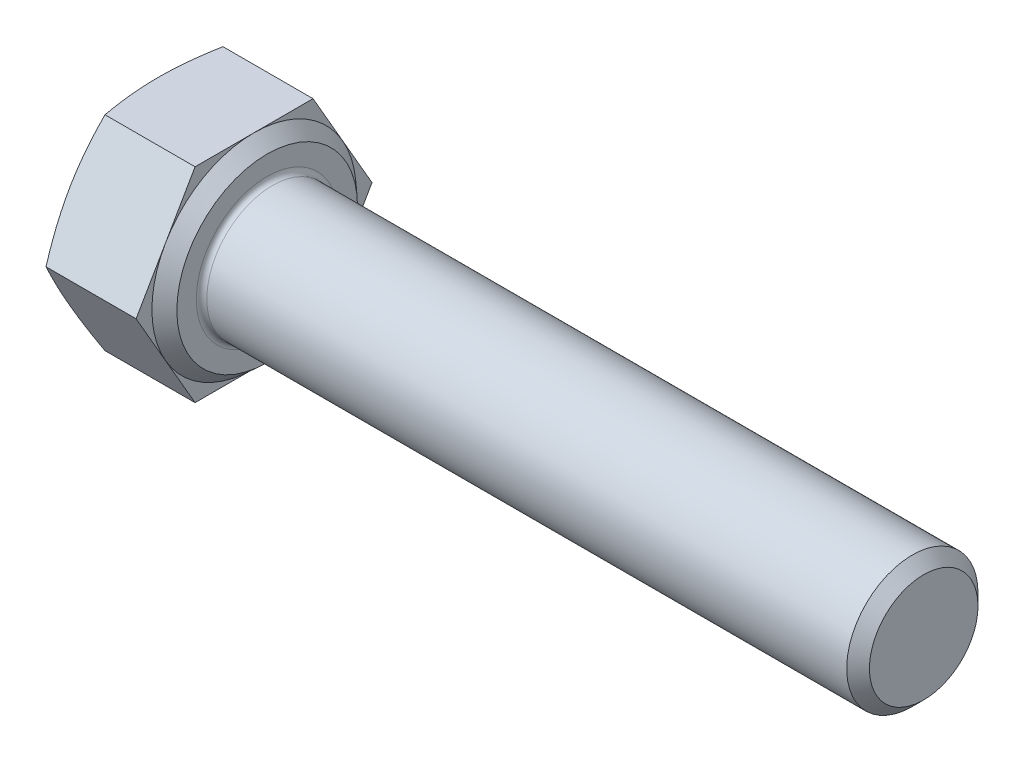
ISO-10303-21;
HEADER;
FILE_DESCRIPTION(('STEP AP214'),'2;1');
FILE_NAME('part.step','',(''),(''),'','','');
FILE_SCHEMA(('AUTOMOTIVE_DESIGN { 1 0 10303 214 1 1 1 1 }'));
ENDSEC;
DATA;
#1=APPLICATION_CONTEXT('core data for automotive mechanical design processes');
#2=APPLICATION_PROTOCOL_DEFINITION('international standard','automotive_design',2000,#1);
#3=PRODUCT_CONTEXT('',#1,'mechanical');
#4=PRODUCT('Part','Part','',(#3));
#5=PRODUCT_RELATED_PRODUCT_CATEGORY('part','',(#4));
#6=PRODUCT_DEFINITION_FORMATION('','',#4);
#7=PRODUCT_DEFINITION_CONTEXT('part definition',#1,'design');
#8=PRODUCT_DEFINITION('design','',#6,#7);
#9=PRODUCT_DEFINITION_SHAPE('','',#8);
#10=(LENGTH_UNIT() NAMED_UNIT(*) SI_UNIT(.MILLI.,.METRE.));
#11=(NAMED_UNIT(*) PLANE_ANGLE_UNIT() SI_UNIT($,.RADIAN.));
#12=(NAMED_UNIT(*) SI_UNIT($,.STERADIAN.) SOLID_ANGLE_UNIT());
#13=UNCERTAINTY_MEASURE_WITH_UNIT(LENGTH_MEASURE(1.E-05),#10,'distance_accuracy_value','');
#14=(GEOMETRIC_REPRESENTATION_CONTEXT(3) GLOBAL_UNCERTAINTY_ASSIGNED_CONTEXT((#13)) GLOBAL_UNIT_ASSIGNED_CONTEXT((#10,
#11,#12)) REPRESENTATION_CONTEXT('',''));
#15=CARTESIAN_POINT('',(0.,0.,0.));
#16=DIRECTION('',(0.,0.,1.));
#17=DIRECTION('',(1.,0.,0.));
#18=AXIS2_PLACEMENT_3D('',#15,#16,#17);
#19=CARTESIAN_POINT('',(4.15,0.,0.));
#20=DIRECTION('',(1.,0.,0.));
#21=DIRECTION('',(0.,0.,-1.));
#22=AXIS2_PLACEMENT_3D('',#19,#20,#21);
#23=PLANE('',#22);
#24=CARTESIAN_POINT('',(4.15,0.,0.));
#25=DIRECTION('',(1.,0.,0.));
#26=DIRECTION('',(0.,0.,-1.));
#27=AXIS2_PLACEMENT_3D('',#24,#25,#26);
#28=CIRCLE('',#27,2.7);
#29=CARTESIAN_POINT('',(4.15,0.,-2.7));
#30=VERTEX_POINT('',#29);
#31=EDGE_CURVE('E188',#30,#30,#28,.F.);
#32=ORIENTED_EDGE('',*,*,#31,.T.);
#33=EDGE_LOOP('',(#32));
#34=FACE_BOUND('',#33,.T.);
#35=CARTESIAN_POINT('',(4.15,0.,0.));
#36=DIRECTION('',(-1.,0.,0.));
#37=DIRECTION('',(0.,0.,1.));
#38=AXIS2_PLACEMENT_3D('',#35,#36,#37);
#39=CIRCLE('',#38,3.44);
#40=CARTESIAN_POINT('',(4.15,0.,3.44));
#41=VERTEX_POINT('',#40);
#42=EDGE_CURVE('E139',#41,#41,#39,.T.);
#43=ORIENTED_EDGE('',*,*,#42,.F.);
#44=EDGE_LOOP('',(#43));
#45=FACE_BOUND('',#44,.T.);
#46=ADVANCED_FACE('F33',(#34,#45),#23,.T.);
#47=CARTESIAN_POINT('',(3.65,0.,-4.49178509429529));
#48=DIRECTION('',(1.,0.,0.));
#49=DIRECTION('',(0.,0.,-1.));
#50=AXIS2_PLACEMENT_3D('',#47,#48,#49);
#51=PLANE('',#50);
#52=DIRECTION('',(0.,-0.866025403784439,0.5));
#53=VECTOR('',#52,1.);
#54=CARTESIAN_POINT('',(3.65,3.89,2.24589254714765));
#55=LINE('',#54,#53);
#56=CARTESIAN_POINT('',(3.65,3.89,2.24589254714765));
#57=VERTEX_POINT('',#56);
#58=CARTESIAN_POINT('',(3.65,1.945,3.36883882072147));
#59=VERTEX_POINT('',#58);
#60=EDGE_CURVE('E138',#57,#59,#55,.T.);
#61=ORIENTED_EDGE('',*,*,#60,.T.);
#62=CARTESIAN_POINT('',(3.65,0.,0.));
#63=DIRECTION('',(-1.,0.,0.));
#64=DIRECTION('',(0.,0.,1.));
#65=AXIS2_PLACEMENT_3D('',#62,#63,#64);
#66=CIRCLE('',#65,3.89);
#67=CARTESIAN_POINT('',(3.65,3.89,0.));
#68=VERTEX_POINT('',#67);
#69=EDGE_CURVE('E49',#59,#68,#66,.T.);
#70=ORIENTED_EDGE('',*,*,#69,.T.);
#71=DIRECTION('',(0.,0.,1.));
#72=VECTOR('',#71,1.);
#73=CARTESIAN_POINT('',(3.65,3.89,-2.24589254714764));
#74=LINE('',#73,#72);
#75=EDGE_CURVE('E135',#68,#57,#74,.T.);
#76=ORIENTED_EDGE('',*,*,#75,.T.);
#77=EDGE_LOOP('',(#61,#70,#76));
#78=FACE_BOUND('',#77,.T.);
#79=ADVANCED_FACE('F134',(#78),#51,.T.);
#80=CARTESIAN_POINT('',(3.65,3.89,-2.24589254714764));
#81=VERTEX_POINT('',#80);
#82=EDGE_CURVE('E145',#81,#68,#74,.T.);
#83=ORIENTED_EDGE('',*,*,#82,.T.);
#84=CARTESIAN_POINT('',(3.65,1.945,-3.36883882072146));
#85=VERTEX_POINT('',#84);
#86=EDGE_CURVE('E122',#68,#85,#66,.T.);
#87=ORIENTED_EDGE('',*,*,#86,.T.);
#88=DIRECTION('',(0.,0.866025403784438,0.5));
#89=VECTOR('',#88,1.);
#90=CARTESIAN_POINT('',(3.65,0.,-4.49178509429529));
#91=LINE('',#90,#89);
#92=EDGE_CURVE('E151',#85,#81,#91,.T.);
#93=ORIENTED_EDGE('',*,*,#92,.T.);
#94=EDGE_LOOP('',(#83,#87,#93));
#95=FACE_BOUND('',#94,.T.);
#96=ADVANCED_FACE('F150',(#95),#51,.T.);
#97=CARTESIAN_POINT('',(3.65,0.,-4.49178509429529));
#98=VERTEX_POINT('',#97);
#99=EDGE_CURVE('E148',#98,#85,#91,.T.);
#100=ORIENTED_EDGE('',*,*,#99,.T.);
#101=CARTESIAN_POINT('',(3.65,-1.945,-3.36883882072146));
#102=VERTEX_POINT('',#101);
#103=EDGE_CURVE('E125',#85,#102,#66,.T.);
#104=ORIENTED_EDGE('',*,*,#103,.T.);
#105=DIRECTION('',(0.,0.866025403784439,-0.5));
#106=VECTOR('',#105,1.);
#107=CARTESIAN_POINT('',(3.65,-3.89,-2.24589254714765));
#108=LINE('',#107,#106);
#109=EDGE_CURVE('E306',#102,#98,#108,.T.);
#110=ORIENTED_EDGE('',*,*,#109,.T.);
#111=EDGE_LOOP('',(#100,#104,#110));
#112=FACE_BOUND('',#111,.T.);
#113=ADVANCED_FACE('F337',(#112),#51,.T.);
#114=CARTESIAN_POINT('',(3.65,-3.89,-2.24589254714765));
#115=VERTEX_POINT('',#114);
#116=EDGE_CURVE('E304',#115,#102,#108,.T.);
#117=ORIENTED_EDGE('',*,*,#116,.T.);
#118=CARTESIAN_POINT('',(3.65,-3.89,0.));
#119=VERTEX_POINT('',#118);
#120=EDGE_CURVE('E338',#102,#119,#66,.T.);
#121=ORIENTED_EDGE('',*,*,#120,.T.);
#122=DIRECTION('',(0.,0.,-1.));
#123=VECTOR('',#122,1.);
#124=CARTESIAN_POINT('',(3.65,-3.89,2.24589254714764));
#125=LINE('',#124,#123);
#126=EDGE_CURVE('E162',#119,#115,#125,.T.);
#127=ORIENTED_EDGE('',*,*,#126,.T.);
#128=EDGE_LOOP('',(#117,#121,#127));
#129=FACE_BOUND('',#128,.T.);
#130=ADVANCED_FACE('F352',(#129),#51,.T.);
#131=CARTESIAN_POINT('',(3.65,-3.89,2.24589254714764));
#132=VERTEX_POINT('',#131);
#133=EDGE_CURVE('E163',#132,#119,#125,.T.);
#134=ORIENTED_EDGE('',*,*,#133,.T.);
#135=CARTESIAN_POINT('',(3.65,-1.945,3.36883882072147));
#136=VERTEX_POINT('',#135);
#137=EDGE_CURVE('E339',#119,#136,#66,.T.);
#138=ORIENTED_EDGE('',*,*,#137,.T.);
#139=DIRECTION('',(0.,-0.866025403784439,-0.5));
#140=VECTOR('',#139,1.);
#141=CARTESIAN_POINT('',(3.65,0.,4.49178509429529));
#142=LINE('',#141,#140);
#143=EDGE_CURVE('E158',#136,#132,#142,.T.);
#144=ORIENTED_EDGE('',*,*,#143,.T.);
#145=EDGE_LOOP('',(#134,#138,#144));
#146=FACE_BOUND('',#145,.T.);
#147=ADVANCED_FACE('F347',(#146),#51,.T.);
#148=CARTESIAN_POINT('',(3.65,0.,4.49178509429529));
#149=VERTEX_POINT('',#148);
#150=EDGE_CURVE('E159',#149,#136,#142,.T.);
#151=ORIENTED_EDGE('',*,*,#150,.T.);
#152=EDGE_CURVE('E140',#136,#59,#66,.T.);
#153=ORIENTED_EDGE('',*,*,#152,.T.);
#154=EDGE_CURVE('E153',#59,#149,#55,.T.);
#155=ORIENTED_EDGE('',*,*,#154,.T.);
#156=EDGE_LOOP('',(#151,#153,#155));
#157=FACE_BOUND('',#156,.T.);
#158=ADVANCED_FACE('F213',(#157),#51,.T.);
#159=CARTESIAN_POINT('',(3.65,-3.89,-2.24589254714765));
#160=DIRECTION('',(0.,0.5,0.866025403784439));
#161=DIRECTION('',(0.,-0.866025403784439,0.5));
#162=AXIS2_PLACEMENT_3D('',#159,#160,#161);
#163=PLANE('',#162);
#164=CARTESIAN_POINT('',(0.21907389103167,0.000199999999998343,-4.49190056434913));
#165=CARTESIAN_POINT('',(0.185204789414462,-0.160909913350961,-4.39888371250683));
#166=CARTESIAN_POINT('',(0.154394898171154,-0.322551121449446,-4.30556011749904));
#167=CARTESIAN_POINT('',(0.100189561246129,-0.646884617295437,-4.11830608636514));
#168=CARTESIAN_POINT('',(0.0767999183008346,-0.809577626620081,-4.02437523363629));
#169=CARTESIAN_POINT('',(0.0389678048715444,-1.13420907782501,-3.8369491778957));
#170=CARTESIAN_POINT('',(0.0244428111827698,-1.29614010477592,-3.74345825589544));
#171=CARTESIAN_POINT('',(0.00496070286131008,-1.62038086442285,-3.55625776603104));
#172=CARTESIAN_POINT('',(0.,-1.78269043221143,-3.46254829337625));
#173=CARTESIAN_POINT('',(0.,-2.10730956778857,-3.27512934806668));
#174=CARTESIAN_POINT('',(0.00496070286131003,-2.26961913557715,-3.1814198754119));
#175=CARTESIAN_POINT('',(0.0244428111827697,-2.59385989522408,-2.99421938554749));
#176=CARTESIAN_POINT('',(0.0389678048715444,-2.75579092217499,-2.90072846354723));
#177=CARTESIAN_POINT('',(0.0767999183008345,-3.08042237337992,-2.71330240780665));
#178=CARTESIAN_POINT('',(0.100189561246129,-3.24311538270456,-2.61937155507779));
#179=CARTESIAN_POINT('',(0.154394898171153,-3.56744887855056,-2.4321175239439));
#180=CARTESIAN_POINT('',(0.185204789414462,-3.72909008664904,-2.3387939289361));
#181=CARTESIAN_POINT('',(0.21907389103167,-3.8902,-2.24577707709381));
#182=B_SPLINE_CURVE_WITH_KNOTS('',3,(#164,#165,#166,#167,#168,#169,#170,#171,#172,#173,#174,
#175,#176,#177,#178,#179,#180,#181),.UNSPECIFIED.,.F.,.F.,(4,2,2,2,2,2,2,2,4),(0.,
0.567333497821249,1.13510957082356,1.69751607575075,2.25971154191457,2.82190700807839,
3.38431351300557,3.95208958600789,4.51942308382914),.UNSPECIFIED.);
#183=CARTESIAN_POINT('',(0.219031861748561,0.,-4.49178509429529));
#184=VERTEX_POINT('',#183);
#185=CARTESIAN_POINT('',(0.,-1.945,-3.36883882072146));
#186=VERTEX_POINT('',#185);
#187=EDGE_CURVE('E321',#184,#186,#182,.T.);
#188=ORIENTED_EDGE('',*,*,#187,.F.);
#189=DIRECTION('',(-1.,0.,0.));
#190=VECTOR('',#189,1.);
#191=CARTESIAN_POINT('',(3.65,0.,-4.49178509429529));
#192=LINE('',#191,#190);
#193=EDGE_CURVE('E178',#98,#184,#192,.T.);
#194=ORIENTED_EDGE('',*,*,#193,.F.);
#195=ORIENTED_EDGE('',*,*,#109,.F.);
#196=ORIENTED_EDGE('',*,*,#116,.F.);
#197=DIRECTION('',(-1.,0.,0.));
#198=VECTOR('',#197,1.);
#199=CARTESIAN_POINT('',(3.65,-3.89,-2.24589254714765));
#200=LINE('',#199,#198);
#201=CARTESIAN_POINT('',(0.219031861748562,-3.89,-2.24589254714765));
#202=VERTEX_POINT('',#201);
#203=EDGE_CURVE('E166',#115,#202,#200,.T.);
#204=ORIENTED_EDGE('',*,*,#203,.T.);
#205=EDGE_CURVE('E246',#186,#202,#182,.T.);
#206=ORIENTED_EDGE('',*,*,#205,.F.);
#207=EDGE_LOOP('',(#188,#194,#195,#196,#204,#206));
#208=FACE_BOUND('',#207,.T.);
#209=ADVANCED_FACE('F35',(#208),#163,.F.);
#210=CARTESIAN_POINT('',(3.65,0.,-4.49178509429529));
#211=DIRECTION('',(0.,-0.5,0.866025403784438));
#212=DIRECTION('',(0.,-0.866025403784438,-0.5));
#213=AXIS2_PLACEMENT_3D('',#210,#211,#212);
#214=PLANE('',#213);
#215=CARTESIAN_POINT('',(0.219073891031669,3.8902,-2.2457770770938));
#216=CARTESIAN_POINT('',(0.185204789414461,3.72909008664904,-2.3387939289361));
#217=CARTESIAN_POINT('',(0.154394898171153,3.56744887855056,-2.43211752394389));
#218=CARTESIAN_POINT('',(0.100189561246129,3.24311538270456,-2.61937155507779));
#219=CARTESIAN_POINT('',(0.076799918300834,3.08042237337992,-2.71330240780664));
#220=CARTESIAN_POINT('',(0.0389678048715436,2.75579092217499,-2.90072846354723));
#221=CARTESIAN_POINT('',(0.0244428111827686,2.59385989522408,-2.99421938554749));
#222=CARTESIAN_POINT('',(0.00496070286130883,2.26961913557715,-3.1814198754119));
#223=CARTESIAN_POINT('',(0.,2.10730956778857,-3.27512934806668));
#224=CARTESIAN_POINT('',(0.,1.78269043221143,-3.46254829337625));
#225=CARTESIAN_POINT('',(0.00496070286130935,1.62038086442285,-3.55625776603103));
#226=CARTESIAN_POINT('',(0.0244428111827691,1.29614010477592,-3.74345825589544));
#227=CARTESIAN_POINT('',(0.0389678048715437,1.13420907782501,-3.8369491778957));
#228=CARTESIAN_POINT('',(0.0767999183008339,0.809577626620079,-4.02437523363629));
#229=CARTESIAN_POINT('',(0.100189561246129,0.646884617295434,-4.11830608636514));
#230=CARTESIAN_POINT('',(0.154394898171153,0.322551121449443,-4.30556011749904));
#231=CARTESIAN_POINT('',(0.185204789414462,0.160909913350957,-4.39888371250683));
#232=CARTESIAN_POINT('',(0.219073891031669,-0.000200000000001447,-4.49190056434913));
#233=B_SPLINE_CURVE_WITH_KNOTS('',3,(#215,#216,#217,#218,#219,#220,#221,#222,#223,#224,#225,
#226,#227,#228,#229,#230,#231,#232),.UNSPECIFIED.,.F.,.F.,(4,2,2,2,2,2,2,2,4),(0.,
0.567333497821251,1.13510957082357,1.69751607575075,2.25971154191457,2.82190700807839,
3.38431351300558,3.95208958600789,4.51942308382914),.UNSPECIFIED.);
#234=CARTESIAN_POINT('',(0.219031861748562,3.89,-2.24589254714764));
#235=VERTEX_POINT('',#234);
#236=CARTESIAN_POINT('',(0.,1.945,-3.36883882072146));
#237=VERTEX_POINT('',#236);
#238=EDGE_CURVE('E261',#235,#237,#233,.T.);
#239=ORIENTED_EDGE('',*,*,#238,.F.);
#240=DIRECTION('',(-1.,0.,0.));
#241=VECTOR('',#240,1.);
#242=CARTESIAN_POINT('',(3.65,3.89,-2.24589254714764));
#243=LINE('',#242,#241);
#244=EDGE_CURVE('E176',#81,#235,#243,.T.);
#245=ORIENTED_EDGE('',*,*,#244,.F.);
#246=ORIENTED_EDGE('',*,*,#92,.F.);
#247=ORIENTED_EDGE('',*,*,#99,.F.);
#248=ORIENTED_EDGE('',*,*,#193,.T.);
#249=EDGE_CURVE('E257',#237,#184,#233,.T.);
#250=ORIENTED_EDGE('',*,*,#249,.F.);
#251=EDGE_LOOP('',(#239,#245,#246,#247,#248,#250));
#252=FACE_BOUND('',#251,.T.);
#253=ADVANCED_FACE('F267',(#252),#214,.F.);
#254=CARTESIAN_POINT('',(3.65,3.89,-2.24589254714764));
#255=DIRECTION('',(0.,-1.,0.));
#256=DIRECTION('',(0.,0.,-1.));
#257=AXIS2_PLACEMENT_3D('',#254,#255,#256);
#258=PLANE('',#257);
#259=CARTESIAN_POINT('',(1.17041940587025,3.89,-5.94633375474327));
#260=CARTESIAN_POINT('',(1.11682818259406,3.89,-5.77033608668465));
#261=CARTESIAN_POINT('',(1.06386229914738,3.89,-5.59414446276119));
#262=CARTESIAN_POINT('',(0.95952714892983,3.89,-5.24127455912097));
#263=CARTESIAN_POINT('',(0.908158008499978,3.89,-5.06459624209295));
#264=CARTESIAN_POINT('',(0.807276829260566,3.89,-4.7103518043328));
#265=CARTESIAN_POINT('',(0.757768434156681,3.89,-4.53278464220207));
#266=CARTESIAN_POINT('',(0.661188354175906,3.89,-4.17698978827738));
#267=CARTESIAN_POINT('',(0.614116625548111,3.89,-3.99876210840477));
#268=CARTESIAN_POINT('',(0.523573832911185,3.89,-3.64372535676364));
#269=CARTESIAN_POINT('',(0.480065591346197,3.89,-3.46692581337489));
#270=CARTESIAN_POINT('',(0.396755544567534,3.89,-3.11245591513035));
#271=CARTESIAN_POINT('',(0.356953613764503,3.89,-2.93478558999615));
#272=CARTESIAN_POINT('',(0.281980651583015,3.89,-2.57852095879));
#273=CARTESIAN_POINT('',(0.246808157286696,3.89,-2.39992696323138));
#274=CARTESIAN_POINT('',(0.182166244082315,3.89,-2.04170211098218));
#275=CARTESIAN_POINT('',(0.152696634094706,3.89,-1.86207128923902));
#276=CARTESIAN_POINT('',(0.103574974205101,3.89,-1.52199551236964));
#277=CARTESIAN_POINT('',(0.0831927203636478,3.89,-1.36165702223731));
#278=CARTESIAN_POINT('',(0.0486915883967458,3.89,-1.04031089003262));
#279=CARTESIAN_POINT('',(0.034572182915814,3.89,-0.879303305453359));
#280=CARTESIAN_POINT('',(0.0132747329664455,3.89,-0.55693233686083));
#281=CARTESIAN_POINT('',(0.00609196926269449,3.89,-0.395569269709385));
#282=CARTESIAN_POINT('',(-0.000967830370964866,3.89,-0.0726817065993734));
#283=CARTESIAN_POINT('',(-0.000844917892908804,3.89,0.088842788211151));
#284=CARTESIAN_POINT('',(0.00671898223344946,3.89,0.412537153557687));
#285=CARTESIAN_POINT('',(0.0141970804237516,3.89,0.574706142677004));
#286=CARTESIAN_POINT('',(0.0361276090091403,3.89,0.898567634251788));
#287=CARTESIAN_POINT('',(0.0505802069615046,3.89,1.06026012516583));
#288=CARTESIAN_POINT('',(0.0857821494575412,3.89,1.38308951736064));
#289=CARTESIAN_POINT('',(0.106536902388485,3.89,1.54422582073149));
#290=CARTESIAN_POINT('',(0.153506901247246,3.89,1.86569012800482));
#291=CARTESIAN_POINT('',(0.179722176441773,3.89,2.02601812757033));
#292=CARTESIAN_POINT('',(0.268261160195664,3.89,2.52267671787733));
#293=CARTESIAN_POINT('',(0.338459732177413,3.89,2.85759948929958));
#294=CARTESIAN_POINT('',(0.492367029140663,3.89,3.52433468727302));
#295=CARTESIAN_POINT('',(0.576080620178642,3.89,3.85614594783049));
#296=CARTESIAN_POINT('',(0.752514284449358,3.89,4.51780195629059));
#297=CARTESIAN_POINT('',(0.845245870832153,3.89,4.84764360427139));
#298=CARTESIAN_POINT('',(1.03667461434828,3.89,5.50551687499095));
#299=CARTESIAN_POINT('',(1.13537082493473,3.89,5.8335487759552));
#300=CARTESIAN_POINT('',(1.33577856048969,3.89,6.48472271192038));
#301=CARTESIAN_POINT('',(1.43744477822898,3.89,6.80787875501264));
#302=CARTESIAN_POINT('',(1.64366502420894,3.89,7.45328212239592));
#303=CARTESIAN_POINT('',(1.74821919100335,3.89,7.77552940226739));
#304=CARTESIAN_POINT('',(1.95903178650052,3.89,8.41811022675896));
#305=CARTESIAN_POINT('',(2.06528224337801,3.89,8.7384463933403));
#306=CARTESIAN_POINT('',(2.27937621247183,3.89,9.37855704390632));
#307=CARTESIAN_POINT('',(2.3872195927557,3.89,9.69833157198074));
#308=CARTESIAN_POINT('',(2.49562026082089,3.89,10.0179143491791));
#309=B_SPLINE_CURVE_WITH_KNOTS('',3,(#259,#260,#261,#262,#263,#264,#265,#266,#267,#268,#269,
#270,#271,#272,#273,#274,#275,#276,#277,#278,#279,#280,#281,#282,#283,#284,#285,#286,#287,#288,
#289,#290,#291,#292,#293,#294,#295,#296,#297,#298,#299,#300,#301,#302,#303,#304,#305,#306,#307,
#308),.UNSPECIFIED.,.F.,.F.,(4,2,2,2,2,2,2,2,2,2,2,2,2,2,2,2,2,2,2,2,2,2,2,2,4),(0.,
0.551932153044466,1.10390786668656,1.65691342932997,2.20990905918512,2.7561003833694,
3.30227319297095,3.84827299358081,4.39425449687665,4.87903442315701,5.36377352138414,
5.84818260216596,6.33258826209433,6.81945059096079,7.3063246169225,7.7936176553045,
8.28091330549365,9.3070152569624,10.3334874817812,11.3612878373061,12.3889255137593,
13.4052202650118,14.4215638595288,15.4340510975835,16.4464549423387),.UNSPECIFIED.);
#310=CARTESIAN_POINT('',(0.219031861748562,3.89,2.24589254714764));
#311=VERTEX_POINT('',#310);
#312=CARTESIAN_POINT('',(0.,3.89,0.));
#313=VERTEX_POINT('',#312);
#314=EDGE_CURVE('E57',#311,#313,#309,.F.);
#315=ORIENTED_EDGE('',*,*,#314,.F.);
#316=DIRECTION('',(-1.,0.,0.));
#317=VECTOR('',#316,1.);
#318=CARTESIAN_POINT('',(3.65,3.89,2.24589254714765));
#319=LINE('',#318,#317);
#320=EDGE_CURVE('E147',#57,#311,#319,.T.);
#321=ORIENTED_EDGE('',*,*,#320,.F.);
#322=ORIENTED_EDGE('',*,*,#75,.F.);
#323=ORIENTED_EDGE('',*,*,#82,.F.);
#324=ORIENTED_EDGE('',*,*,#244,.T.);
#325=EDGE_CURVE('E262',#313,#235,#309,.F.);
#326=ORIENTED_EDGE('',*,*,#325,.F.);
#327=EDGE_LOOP('',(#315,#321,#322,#323,#324,#326));
#328=FACE_BOUND('',#327,.T.);
#329=ADVANCED_FACE('F143',(#328),#258,.F.);
#330=CARTESIAN_POINT('',(3.65,3.89,2.24589254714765));
#331=DIRECTION('',(0.,-0.5,-0.866025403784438));
#332=DIRECTION('',(0.,0.866025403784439,-0.5));
#333=AXIS2_PLACEMENT_3D('',#330,#331,#332);
#334=PLANE('',#333);
#335=CARTESIAN_POINT('',(0.21907389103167,-0.000199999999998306,4.49190056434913));
#336=CARTESIAN_POINT('',(0.185204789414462,0.160909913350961,4.39888371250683));
#337=CARTESIAN_POINT('',(0.154394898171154,0.322551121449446,4.30556011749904));
#338=CARTESIAN_POINT('',(0.10018956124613,0.646884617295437,4.11830608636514));
#339=CARTESIAN_POINT('',(0.0767999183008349,0.809577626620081,4.02437523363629));
#340=CARTESIAN_POINT('',(0.0389678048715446,1.13420907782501,3.8369491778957));
#341=CARTESIAN_POINT('',(0.0244428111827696,1.29614010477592,3.74345825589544));
#342=CARTESIAN_POINT('',(0.0049607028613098,1.62038086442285,3.55625776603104));
#343=CARTESIAN_POINT('',(0.,1.78269043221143,3.46254829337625));
#344=CARTESIAN_POINT('',(0.,2.10730956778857,3.27512934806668));
#345=CARTESIAN_POINT('',(0.00496070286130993,2.26961913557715,3.1814198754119));
#346=CARTESIAN_POINT('',(0.0244428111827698,2.59385989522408,2.99421938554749));
#347=CARTESIAN_POINT('',(0.0389678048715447,2.75579092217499,2.90072846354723));
#348=CARTESIAN_POINT('',(0.0767999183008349,3.08042237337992,2.71330240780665));
#349=CARTESIAN_POINT('',(0.100189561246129,3.24311538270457,2.61937155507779));
#350=CARTESIAN_POINT('',(0.154394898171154,3.56744887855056,2.4321175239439));
#351=CARTESIAN_POINT('',(0.185204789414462,3.72909008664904,2.3387939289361));
#352=CARTESIAN_POINT('',(0.21907389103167,3.8902,2.24577707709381));
#353=B_SPLINE_CURVE_WITH_KNOTS('',3,(#335,#336,#337,#338,#339,#340,#341,#342,#343,#344,#345,
#346,#347,#348,#349,#350,#351,#352),.UNSPECIFIED.,.F.,.F.,(4,2,2,2,2,2,2,2,4),(0.,
0.56733349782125,1.13510957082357,1.69751607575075,2.25971154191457,2.82190700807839,
3.38431351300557,3.95208958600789,4.51942308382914),.UNSPECIFIED.);
#354=CARTESIAN_POINT('',(0.219031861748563,0.,4.49178509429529));
#355=VERTEX_POINT('',#354);
#356=CARTESIAN_POINT('',(0.,1.945,3.36883882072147));
#357=VERTEX_POINT('',#356);
#358=EDGE_CURVE('E251',#355,#357,#353,.T.);
#359=ORIENTED_EDGE('',*,*,#358,.F.);
#360=DIRECTION('',(-1.,0.,0.));
#361=VECTOR('',#360,1.);
#362=CARTESIAN_POINT('',(3.65,0.,4.49178509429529));
#363=LINE('',#362,#361);
#364=EDGE_CURVE('E172',#149,#355,#363,.T.);
#365=ORIENTED_EDGE('',*,*,#364,.F.);
#366=ORIENTED_EDGE('',*,*,#154,.F.);
#367=ORIENTED_EDGE('',*,*,#60,.F.);
#368=ORIENTED_EDGE('',*,*,#320,.T.);
#369=EDGE_CURVE('E312',#357,#311,#353,.T.);
#370=ORIENTED_EDGE('',*,*,#369,.F.);
#371=EDGE_LOOP('',(#359,#365,#366,#367,#368,#370));
#372=FACE_BOUND('',#371,.T.);
#373=ADVANCED_FACE('F273',(#372),#334,.F.);
#374=CARTESIAN_POINT('',(3.65,0.,4.49178509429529));
#375=DIRECTION('',(0.,0.5,-0.866025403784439));
#376=DIRECTION('',(0.,0.866025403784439,0.5));
#377=AXIS2_PLACEMENT_3D('',#374,#375,#376);
#378=PLANE('',#377);
#379=CARTESIAN_POINT('',(0.219073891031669,-3.8902,2.24577707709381));
#380=CARTESIAN_POINT('',(0.185204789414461,-3.72909008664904,2.3387939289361));
#381=CARTESIAN_POINT('',(0.154394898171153,-3.56744887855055,2.4321175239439));
#382=CARTESIAN_POINT('',(0.100189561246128,-3.24311538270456,2.61937155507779));
#383=CARTESIAN_POINT('',(0.0767999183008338,-3.08042237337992,2.71330240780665));
#384=CARTESIAN_POINT('',(0.0389678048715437,-2.75579092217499,2.90072846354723));
#385=CARTESIAN_POINT('',(0.0244428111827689,-2.59385989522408,2.99421938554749));
#386=CARTESIAN_POINT('',(0.00496070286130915,-2.26961913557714,3.1814198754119));
#387=CARTESIAN_POINT('',(0.,-2.10730956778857,3.27512934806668));
#388=CARTESIAN_POINT('',(0.,-1.78269043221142,3.46254829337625));
#389=CARTESIAN_POINT('',(0.00496070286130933,-1.62038086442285,3.55625776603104));
#390=CARTESIAN_POINT('',(0.0244428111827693,-1.29614010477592,3.74345825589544));
#391=CARTESIAN_POINT('',(0.0389678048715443,-1.13420907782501,3.8369491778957));
#392=CARTESIAN_POINT('',(0.0767999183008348,-0.809577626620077,4.02437523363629));
#393=CARTESIAN_POINT('',(0.10018956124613,-0.646884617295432,4.11830608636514));
#394=CARTESIAN_POINT('',(0.154394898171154,-0.322551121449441,4.30556011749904));
#395=CARTESIAN_POINT('',(0.185204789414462,-0.160909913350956,4.39888371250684));
#396=CARTESIAN_POINT('',(0.21907389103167,0.000200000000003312,4.49190056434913));
#397=B_SPLINE_CURVE_WITH_KNOTS('',3,(#379,#380,#381,#382,#383,#384,#385,#386,#387,#388,#389,
#390,#391,#392,#393,#394,#395,#396),.UNSPECIFIED.,.F.,.F.,(4,2,2,2,2,2,2,2,4),(0.,
0.56733349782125,1.13510957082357,1.69751607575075,2.25971154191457,2.82190700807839,
3.38431351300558,3.95208958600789,4.51942308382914),.UNSPECIFIED.);
#398=CARTESIAN_POINT('',(0.219031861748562,-3.89,2.24589254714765));
#399=VERTEX_POINT('',#398);
#400=CARTESIAN_POINT('',(0.,-1.945,3.36883882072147));
#401=VERTEX_POINT('',#400);
#402=EDGE_CURVE('E239',#399,#401,#397,.T.);
#403=ORIENTED_EDGE('',*,*,#402,.F.);
#404=DIRECTION('',(-1.,0.,0.));
#405=VECTOR('',#404,1.);
#406=CARTESIAN_POINT('',(3.65,-3.89,2.24589254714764));
#407=LINE('',#406,#405);
#408=EDGE_CURVE('E169',#132,#399,#407,.T.);
#409=ORIENTED_EDGE('',*,*,#408,.F.);
#410=ORIENTED_EDGE('',*,*,#143,.F.);
#411=ORIENTED_EDGE('',*,*,#150,.F.);
#412=ORIENTED_EDGE('',*,*,#364,.T.);
#413=EDGE_CURVE('E317',#401,#355,#397,.T.);
#414=ORIENTED_EDGE('',*,*,#413,.F.);
#415=EDGE_LOOP('',(#403,#409,#410,#411,#412,#414));
#416=FACE_BOUND('',#415,.T.);
#417=ADVANCED_FACE('F276',(#416),#378,.F.);
#418=CARTESIAN_POINT('',(3.65,-3.89,2.24589254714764));
#419=DIRECTION('',(0.,1.,0.));
#420=DIRECTION('',(0.,0.,1.));
#421=AXIS2_PLACEMENT_3D('',#418,#419,#420);
#422=PLANE('',#421);
#423=CARTESIAN_POINT('',(1.17041940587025,-3.89,-5.94633375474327));
#424=CARTESIAN_POINT('',(1.11682818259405,-3.89,-5.77033608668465));
#425=CARTESIAN_POINT('',(1.06386229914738,-3.89,-5.5941444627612));
#426=CARTESIAN_POINT('',(0.959527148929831,-3.89,-5.24127455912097));
#427=CARTESIAN_POINT('',(0.908158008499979,-3.89,-5.06459624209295));
#428=CARTESIAN_POINT('',(0.807276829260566,-3.89,-4.7103518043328));
#429=CARTESIAN_POINT('',(0.757768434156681,-3.89,-4.53278464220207));
#430=CARTESIAN_POINT('',(0.661188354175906,-3.89,-4.17698978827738));
#431=CARTESIAN_POINT('',(0.614116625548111,-3.89,-3.99876210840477));
#432=CARTESIAN_POINT('',(0.523573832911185,-3.89,-3.64372535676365));
#433=CARTESIAN_POINT('',(0.480065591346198,-3.89,-3.46692581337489));
#434=CARTESIAN_POINT('',(0.396755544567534,-3.89,-3.11245591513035));
#435=CARTESIAN_POINT('',(0.356953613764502,-3.89,-2.93478558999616));
#436=CARTESIAN_POINT('',(0.281980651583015,-3.89,-2.57852095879));
#437=CARTESIAN_POINT('',(0.246808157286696,-3.89,-2.39992696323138));
#438=CARTESIAN_POINT('',(0.182166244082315,-3.89,-2.04170211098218));
#439=CARTESIAN_POINT('',(0.152696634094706,-3.89,-1.86207128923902));
#440=CARTESIAN_POINT('',(0.103574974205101,-3.89,-1.52199551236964));
#441=CARTESIAN_POINT('',(0.0831927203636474,-3.89,-1.36165702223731));
#442=CARTESIAN_POINT('',(0.0486915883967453,-3.89,-1.04031089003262));
#443=CARTESIAN_POINT('',(0.0345721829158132,-3.89,-0.879303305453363));
#444=CARTESIAN_POINT('',(0.0132747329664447,-3.89,-0.556932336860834));
#445=CARTESIAN_POINT('',(0.00609196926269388,-3.89,-0.395569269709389));
#446=CARTESIAN_POINT('',(-0.000967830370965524,-3.89,-0.0726817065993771));
#447=CARTESIAN_POINT('',(-0.000844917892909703,-3.89,0.0888427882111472));
#448=CARTESIAN_POINT('',(0.00671898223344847,-3.89,0.412537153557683));
#449=CARTESIAN_POINT('',(0.0141970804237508,-3.89,0.574706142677));
#450=CARTESIAN_POINT('',(0.0361276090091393,-3.89,0.898567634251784));
#451=CARTESIAN_POINT('',(0.0505802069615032,-3.89,1.06026012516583));
#452=CARTESIAN_POINT('',(0.0857821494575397,-3.89,1.38308951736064));
#453=CARTESIAN_POINT('',(0.106536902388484,-3.89,1.54422582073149));
#454=CARTESIAN_POINT('',(0.153506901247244,-3.89,1.86569012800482));
#455=CARTESIAN_POINT('',(0.179722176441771,-3.89,2.02601812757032));
#456=CARTESIAN_POINT('',(0.268261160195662,-3.89,2.52267671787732));
#457=CARTESIAN_POINT('',(0.338459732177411,-3.89,2.85759948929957));
#458=CARTESIAN_POINT('',(0.492367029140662,-3.89,3.52433468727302));
#459=CARTESIAN_POINT('',(0.57608062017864,-3.89,3.85614594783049));
#460=CARTESIAN_POINT('',(0.752514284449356,-3.89,4.51780195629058));
#461=CARTESIAN_POINT('',(0.845245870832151,-3.89,4.84764360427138));
#462=CARTESIAN_POINT('',(1.03667461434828,-3.89,5.50551687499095));
#463=CARTESIAN_POINT('',(1.13537082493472,-3.89,5.83354877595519));
#464=CARTESIAN_POINT('',(1.33577856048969,-3.89,6.48472271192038));
#465=CARTESIAN_POINT('',(1.43744477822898,-3.89,6.80787875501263));
#466=CARTESIAN_POINT('',(1.64366502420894,-3.89,7.45328212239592));
#467=CARTESIAN_POINT('',(1.74821919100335,-3.89,7.77552940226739));
#468=CARTESIAN_POINT('',(1.95903178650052,-3.89,8.41811022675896));
#469=CARTESIAN_POINT('',(2.06528224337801,-3.89,8.7384463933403));
#470=CARTESIAN_POINT('',(2.27937621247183,-3.89,9.37855704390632));
#471=CARTESIAN_POINT('',(2.3872195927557,-3.89,9.69833157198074));
#472=CARTESIAN_POINT('',(2.49562026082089,-3.89,10.0179143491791));
#473=B_SPLINE_CURVE_WITH_KNOTS('',3,(#423,#424,#425,#426,#427,#428,#429,#430,#431,#432,#433,
#434,#435,#436,#437,#438,#439,#440,#441,#442,#443,#444,#445,#446,#447,#448,#449,#450,#451,#452,
#453,#454,#455,#456,#457,#458,#459,#460,#461,#462,#463,#464,#465,#466,#467,#468,#469,#470,#471,
#472),.UNSPECIFIED.,.F.,.F.,(4,2,2,2,2,2,2,2,2,2,2,2,2,2,2,2,2,2,2,2,2,2,2,2,4),(0.,
0.551932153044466,1.10390786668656,1.65691342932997,2.20990905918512,2.7561003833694,
3.30227319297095,3.84827299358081,4.39425449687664,4.87903442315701,5.36377352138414,
5.84818260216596,6.33258826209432,6.81945059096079,7.3063246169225,7.79361765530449,
8.28091330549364,9.30701525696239,10.3334874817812,11.3612878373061,12.3889255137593,
13.4052202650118,14.4215638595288,15.4340510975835,16.4464549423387),.UNSPECIFIED.);
#474=CARTESIAN_POINT('',(0.,-3.89,0.));
#475=VERTEX_POINT('',#474);
#476=EDGE_CURVE('E295',#202,#475,#473,.T.);
#477=ORIENTED_EDGE('',*,*,#476,.F.);
#478=ORIENTED_EDGE('',*,*,#203,.F.);
#479=ORIENTED_EDGE('',*,*,#126,.F.);
#480=ORIENTED_EDGE('',*,*,#133,.F.);
#481=ORIENTED_EDGE('',*,*,#408,.T.);
#482=EDGE_CURVE('E229',#475,#399,#473,.T.);
#483=ORIENTED_EDGE('',*,*,#482,.F.);
#484=EDGE_LOOP('',(#477,#478,#479,#480,#481,#483));
#485=FACE_BOUND('',#484,.T.);
#486=ADVANCED_FACE('F280',(#485),#422,.F.);
#487=CARTESIAN_POINT('',(0.,0.,0.));
#488=DIRECTION('',(1.,0.,0.));
#489=DIRECTION('',(0.,0.,-1.));
#490=AXIS2_PLACEMENT_3D('',#487,#488,#489);
#491=CONICAL_SURFACE('',#490,3.89,1.22173047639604);
#492=ORIENTED_EDGE('',*,*,#249,.T.);
#493=ORIENTED_EDGE('',*,*,#187,.T.);
#494=CARTESIAN_POINT('',(0.,0.,0.));
#495=DIRECTION('',(1.,0.,0.));
#496=DIRECTION('',(0.,0.,-1.));
#497=AXIS2_PLACEMENT_3D('',#494,#495,#496);
#498=CIRCLE('',#497,3.89);
#499=EDGE_CURVE('E181',#186,#237,#498,.T.);
#500=ORIENTED_EDGE('',*,*,#499,.T.);
#501=EDGE_LOOP('',(#492,#493,#500));
#502=FACE_BOUND('',#501,.T.);
#503=ADVANCED_FACE('F284',(#502),#491,.T.);
#504=ORIENTED_EDGE('',*,*,#205,.T.);
#505=ORIENTED_EDGE('',*,*,#476,.T.);
#506=EDGE_CURVE('E184',#475,#186,#498,.T.);
#507=ORIENTED_EDGE('',*,*,#506,.T.);
#508=EDGE_LOOP('',(#504,#505,#507));
#509=FACE_BOUND('',#508,.T.);
#510=ADVANCED_FACE('F289',(#509),#491,.T.);
#511=ORIENTED_EDGE('',*,*,#402,.T.);
#512=EDGE_CURVE('E330',#401,#475,#498,.T.);
#513=ORIENTED_EDGE('',*,*,#512,.T.);
#514=ORIENTED_EDGE('',*,*,#482,.T.);
#515=EDGE_LOOP('',(#511,#513,#514));
#516=FACE_BOUND('',#515,.T.);
#517=ADVANCED_FACE('F224',(#516),#491,.T.);
#518=ORIENTED_EDGE('',*,*,#358,.T.);
#519=EDGE_CURVE('E336',#357,#401,#498,.T.);
#520=ORIENTED_EDGE('',*,*,#519,.T.);
#521=ORIENTED_EDGE('',*,*,#413,.T.);
#522=EDGE_LOOP('',(#518,#520,#521));
#523=FACE_BOUND('',#522,.T.);
#524=ADVANCED_FACE('F223',(#523),#491,.T.);
#525=ORIENTED_EDGE('',*,*,#314,.T.);
#526=CARTESIAN_POINT('',(0.,0.,0.));
#527=DIRECTION('',(-1.,0.,0.));
#528=DIRECTION('',(0.,0.,1.));
#529=AXIS2_PLACEMENT_3D('',#526,#527,#528);
#530=CIRCLE('',#529,3.89);
#531=EDGE_CURVE('E335',#357,#313,#530,.T.);
#532=ORIENTED_EDGE('',*,*,#531,.F.);
#533=ORIENTED_EDGE('',*,*,#369,.T.);
#534=EDGE_LOOP('',(#525,#532,#533));
#535=FACE_BOUND('',#534,.T.);
#536=ADVANCED_FACE('F218',(#535),#491,.T.);
#537=ORIENTED_EDGE('',*,*,#325,.T.);
#538=ORIENTED_EDGE('',*,*,#238,.T.);
#539=EDGE_CURVE('E185',#237,#313,#498,.T.);
#540=ORIENTED_EDGE('',*,*,#539,.T.);
#541=EDGE_LOOP('',(#537,#538,#540));
#542=FACE_BOUND('',#541,.T.);
#543=ADVANCED_FACE('F222',(#542),#491,.T.);
#544=CARTESIAN_POINT('',(0.,0.,-4.49178509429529));
#545=DIRECTION('',(1.,0.,0.));
#546=DIRECTION('',(0.,0.,-1.));
#547=AXIS2_PLACEMENT_3D('',#544,#545,#546);
#548=PLANE('',#547);
#549=ORIENTED_EDGE('',*,*,#539,.F.);
#550=ORIENTED_EDGE('',*,*,#499,.F.);
#551=ORIENTED_EDGE('',*,*,#506,.F.);
#552=ORIENTED_EDGE('',*,*,#512,.F.);
#553=ORIENTED_EDGE('',*,*,#519,.F.);
#554=ORIENTED_EDGE('',*,*,#531,.T.);
#555=EDGE_LOOP('',(#549,#550,#551,#552,#553,#554));
#556=FACE_BOUND('',#555,.T.);
#557=ADVANCED_FACE('F225',(#556),#548,.F.);
#558=CARTESIAN_POINT('',(3.65,0.,0.));
#559=DIRECTION('',(-1.,0.,0.));
#560=DIRECTION('',(0.,0.,1.));
#561=AXIS2_PLACEMENT_3D('',#558,#559,#560);
#562=CONICAL_SURFACE('',#561,3.89,0.732815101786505);
#563=ORIENTED_EDGE('',*,*,#42,.T.);
#564=EDGE_LOOP('',(#563));
#565=FACE_BOUND('',#564,.T.);
#566=ORIENTED_EDGE('',*,*,#69,.F.);
#567=ORIENTED_EDGE('',*,*,#152,.F.);
#568=ORIENTED_EDGE('',*,*,#137,.F.);
#569=ORIENTED_EDGE('',*,*,#120,.F.);
#570=ORIENTED_EDGE('',*,*,#103,.F.);
#571=ORIENTED_EDGE('',*,*,#86,.F.);
#572=EDGE_LOOP('',(#566,#567,#568,#569,#570,#571));
#573=FACE_BOUND('',#572,.T.);
#574=ADVANCED_FACE('F123',(#565,#573),#562,.T.);
#575=CARTESIAN_POINT('',(29.15,0.,0.));
#576=DIRECTION('',(-1.,0.,0.));
#577=DIRECTION('',(0.,0.,1.));
#578=AXIS2_PLACEMENT_3D('',#575,#576,#577);
#579=CYLINDRICAL_SURFACE('',#578,2.5);
#580=CARTESIAN_POINT('',(28.717,0.,0.));
#581=DIRECTION('',(1.,0.,0.));
#582=DIRECTION('',(0.,0.,-1.));
#583=AXIS2_PLACEMENT_3D('',#580,#581,#582);
#584=CIRCLE('',#583,2.5);
#585=CARTESIAN_POINT('',(28.717,0.,-2.5));
#586=VERTEX_POINT('',#585);
#587=EDGE_CURVE('E12',#586,#586,#584,.F.);
#588=ORIENTED_EDGE('',*,*,#587,.T.);
#589=EDGE_LOOP('',(#588));
#590=FACE_BOUND('',#589,.T.);
#591=CARTESIAN_POINT('',(4.35,0.,0.));
#592=DIRECTION('',(1.,0.,0.));
#593=DIRECTION('',(0.,0.,-1.));
#594=AXIS2_PLACEMENT_3D('',#591,#592,#593);
#595=CIRCLE('',#594,2.5);
#596=CARTESIAN_POINT('',(4.35,0.,-2.5));
#597=VERTEX_POINT('',#596);
#598=EDGE_CURVE('E129',#597,#597,#595,.T.);
#599=ORIENTED_EDGE('',*,*,#598,.T.);
#600=EDGE_LOOP('',(#599));
#601=FACE_BOUND('',#600,.T.);
#602=ADVANCED_FACE('F454',(#590,#601),#579,.T.);
#603=CARTESIAN_POINT('',(29.15,0.,0.));
#604=DIRECTION('',(1.,0.,0.));
#605=DIRECTION('',(0.,0.,-1.));
#606=AXIS2_PLACEMENT_3D('',#603,#604,#605);
#607=PLANE('',#606);
#608=CARTESIAN_POINT('',(29.15,0.,0.));
#609=DIRECTION('',(1.,0.,0.));
#610=DIRECTION('',(0.,0.,-1.));
#611=AXIS2_PLACEMENT_3D('',#608,#609,#610);
#612=CIRCLE('',#611,2.067);
#613=CARTESIAN_POINT('',(29.15,0.,-2.067));
#614=VERTEX_POINT('',#613);
#615=EDGE_CURVE('E42',#614,#614,#612,.T.);
#616=ORIENTED_EDGE('',*,*,#615,.T.);
#617=EDGE_LOOP('',(#616));
#618=FACE_BOUND('',#617,.T.);
#619=ADVANCED_FACE('F193',(#618),#607,.T.);
#620=CARTESIAN_POINT('',(4.35,0.,0.));
#621=DIRECTION('',(1.,0.,0.));
#622=DIRECTION('',(0.,0.,-1.));
#623=AXIS2_PLACEMENT_3D('',#620,#621,#622);
#624=TOROIDAL_SURFACE('',#623,2.7,0.2);
#625=ORIENTED_EDGE('',*,*,#31,.F.);
#626=EDGE_LOOP('',(#625));
#627=FACE_BOUND('',#626,.T.);
#628=ORIENTED_EDGE('',*,*,#598,.F.);
#629=EDGE_LOOP('',(#628));
#630=FACE_BOUND('',#629,.T.);
#631=ADVANCED_FACE('F197',(#627,#630),#624,.F.);
#632=CARTESIAN_POINT('',(29.15,0.,0.));
#633=DIRECTION('',(-1.,0.,0.));
#634=DIRECTION('',(0.,0.,1.));
#635=AXIS2_PLACEMENT_3D('',#632,#633,#634);
#636=CONICAL_SURFACE('',#635,2.067,0.785398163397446);
#637=ORIENTED_EDGE('',*,*,#587,.F.);
#638=EDGE_LOOP('',(#637));
#639=FACE_BOUND('',#638,.T.);
#640=ORIENTED_EDGE('',*,*,#615,.F.);
#641=EDGE_LOOP('',(#640));
#642=FACE_BOUND('',#641,.T.);
#643=ADVANCED_FACE('F195',(#639,#642),#636,.T.);
#644=CLOSED_SHELL('',(#46,#79,#96,#113,#130,#147,#158,#209,#253,#329,#373,#417,#486,#503,#510,
#517,#524,#536,#543,#557,#574,#602,#619,#631,#643));
#645=MANIFOLD_SOLID_BREP('B2',#644);
#646=ADVANCED_BREP_SHAPE_REPRESENTATION('',(#18,#645),#14);
#647=SHAPE_DEFINITION_REPRESENTATION(#9,#646);
ENDSEC;
END-ISO-10303-21;
